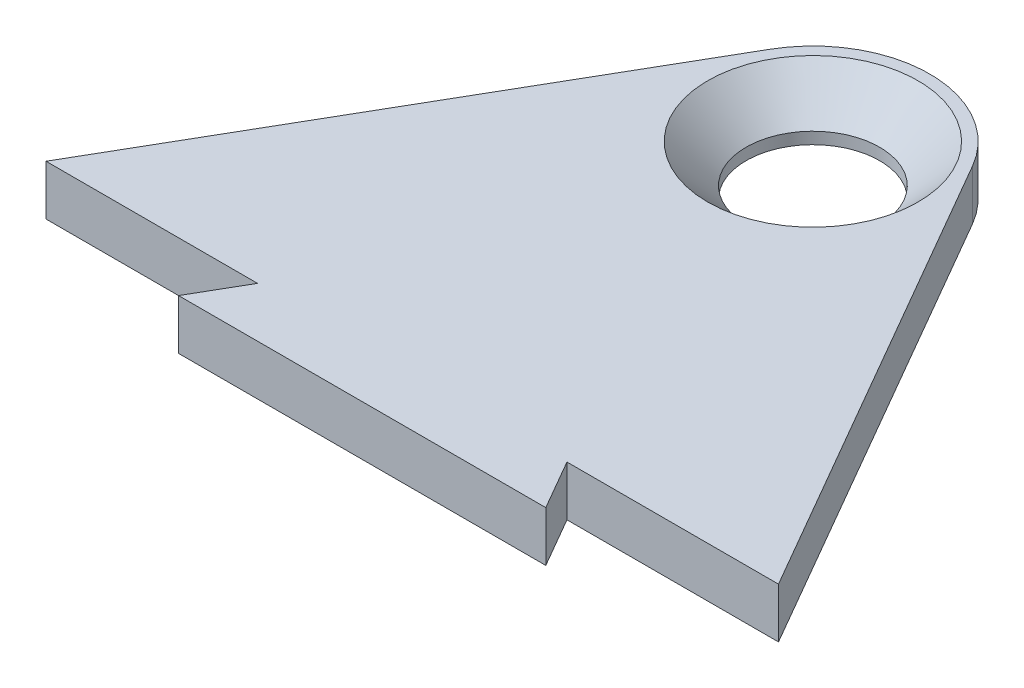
from build123d import *

# Parameters (mm, degrees)
EXTRUDE1_DEPTH = 3


with BuildPart() as part:
    # Sketch1 → Extrude1 (new body)
    with BuildSketch(Plane(origin=(0, 0, 0), x_dir=(1, 0, 0), z_dir=(0, 1, 0))):
        with BuildLine():
            Line((9.267949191, 2.999999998), (21.93931023, 2.999999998))
            Line((21.93931023, 2.999999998), (6.062177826, 30.5))
            ThreePointArc((6.062177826, 30.5), (0, 34), (-6.062177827, 30.499999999))
            Line((-6.062177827, 30.499999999), (-21.93931023, 2.999999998))
            Line((-21.93931023, 2.999999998), (-9.267949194, 2.999999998))
            Line((-9.267949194, 2.999999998), (-11.000000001, 0))
            Line((-11.000000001, 0), (10.999999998, 0))
            Line((10.999999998, 0), (9.267949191, 2.999999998))
        make_face()
    extrude(amount=EXTRUDE1_DEPTH)

    # Sketch4 → CSK for M6 Countersunk Flat Head Screw1 (revolve, cut)
    with BuildSketch(Plane(origin=(0, 3, -27), x_dir=(0, 0, 1), z_dir=(1, 0, 0))):
        Polygon((0, 0), (0, 3), (4, 3), (4, 2.3), (6.3, 0), align=None)
    revolve(axis=Axis((0, 9.35, -27), (0, -1, 0)), mode=Mode.SUBTRACT)


solid = part.part
